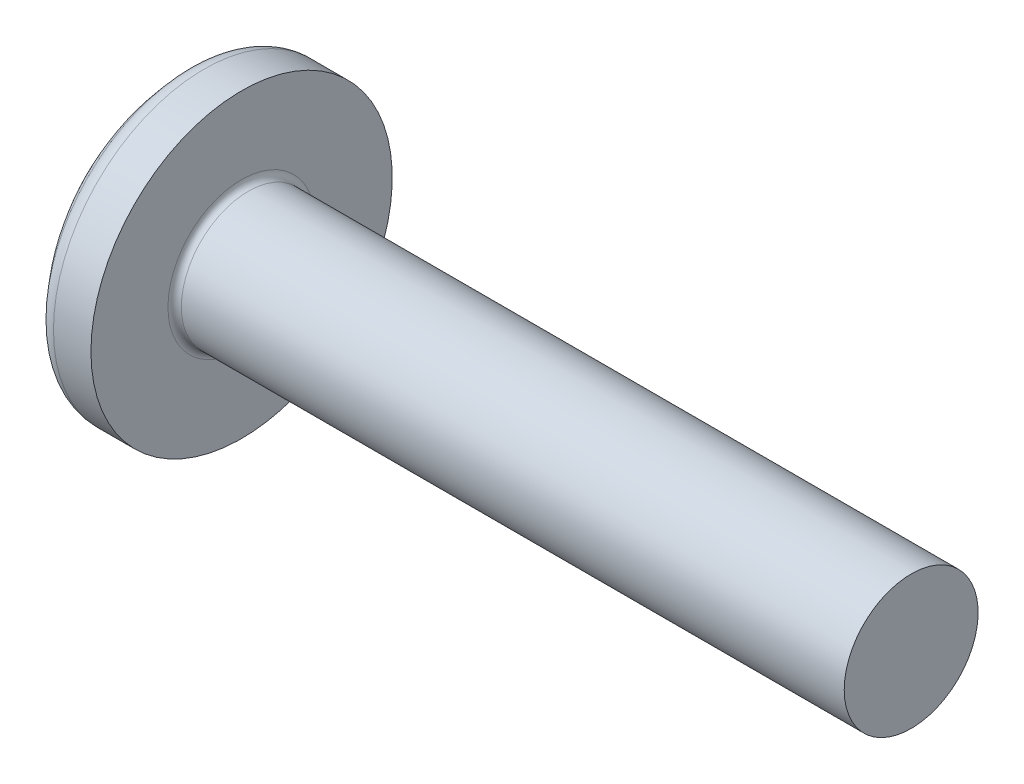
ISO-10303-21;
HEADER;
FILE_DESCRIPTION(('STEP AP214'),'2;1');
FILE_NAME('part.step','',(''),(''),'','','');
FILE_SCHEMA(('AUTOMOTIVE_DESIGN { 1 0 10303 214 1 1 1 1 }'));
ENDSEC;
DATA;
#1=APPLICATION_CONTEXT('core data for automotive mechanical design processes');
#2=APPLICATION_PROTOCOL_DEFINITION('international standard','automotive_design',2000,#1);
#3=PRODUCT_CONTEXT('',#1,'mechanical');
#4=PRODUCT('Part','Part','',(#3));
#5=PRODUCT_RELATED_PRODUCT_CATEGORY('part','',(#4));
#6=PRODUCT_DEFINITION_FORMATION('','',#4);
#7=PRODUCT_DEFINITION_CONTEXT('part definition',#1,'design');
#8=PRODUCT_DEFINITION('design','',#6,#7);
#9=PRODUCT_DEFINITION_SHAPE('','',#8);
#10=(LENGTH_UNIT() NAMED_UNIT(*) SI_UNIT(.MILLI.,.METRE.));
#11=(NAMED_UNIT(*) PLANE_ANGLE_UNIT() SI_UNIT($,.RADIAN.));
#12=(NAMED_UNIT(*) SI_UNIT($,.STERADIAN.) SOLID_ANGLE_UNIT());
#13=UNCERTAINTY_MEASURE_WITH_UNIT(LENGTH_MEASURE(1.E-05),#10,'distance_accuracy_value','');
#14=(GEOMETRIC_REPRESENTATION_CONTEXT(3) GLOBAL_UNCERTAINTY_ASSIGNED_CONTEXT((#13)) GLOBAL_UNIT_ASSIGNED_CONTEXT((#10,
#11,#12)) REPRESENTATION_CONTEXT('',''));
#15=CARTESIAN_POINT('',(0.,0.,0.));
#16=DIRECTION('',(0.,0.,1.));
#17=DIRECTION('',(1.,0.,0.));
#18=AXIS2_PLACEMENT_3D('',#15,#16,#17);
#19=CARTESIAN_POINT('',(3.2,0.,0.));
#20=DIRECTION('',(-1.,0.,0.));
#21=DIRECTION('',(0.,1.,0.));
#22=AXIS2_PLACEMENT_3D('',#19,#20,#21);
#23=SPHERICAL_SURFACE('',#22,3.2);
#24=CARTESIAN_POINT('',(0.841233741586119,0.,0.));
#25=DIRECTION('',(-1.,0.,0.));
#26=DIRECTION('',(0.,0.,1.));
#27=AXIS2_PLACEMENT_3D('',#24,#25,#26);
#28=CIRCLE('',#27,2.16245733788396);
#29=CARTESIAN_POINT('',(0.841233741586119,0.,2.16245733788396));
#30=VERTEX_POINT('',#29);
#31=EDGE_CURVE('E235',#30,#30,#28,.T.);
#32=ORIENTED_EDGE('',*,*,#31,.T.);
#33=EDGE_LOOP('',(#32));
#34=FACE_BOUND('',#33,.T.);
#35=CARTESIAN_POINT('',(0.0716483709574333,0.,0.));
#36=DIRECTION('',(1.,0.,0.));
#37=DIRECTION('',(0.,0.,-1.));
#38=AXIS2_PLACEMENT_3D('',#35,#36,#37);
#39=CIRCLE('',#38,0.673361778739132);
#40=CARTESIAN_POINT('',(0.0716483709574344,-0.369999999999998,-0.562597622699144));
#41=VERTEX_POINT('',#40);
#42=CARTESIAN_POINT('',(0.0716483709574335,-0.56259762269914,-0.37));
#43=VERTEX_POINT('',#42);
#44=EDGE_CURVE('E458',#41,#43,#39,.F.);
#45=ORIENTED_EDGE('',*,*,#44,.F.);
#46=CARTESIAN_POINT('',(3.2,-0.37,0.));
#47=DIRECTION('',(0.,1.,0.));
#48=DIRECTION('',(0.,0.,1.));
#49=AXIS2_PLACEMENT_3D('',#46,#47,#48);
#50=CIRCLE('',#49,3.17853739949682);
#51=CARTESIAN_POINT('',(0.155263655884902,-0.369999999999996,-0.912513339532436));
#52=VERTEX_POINT('',#51);
#53=EDGE_CURVE('E282',#52,#41,#50,.T.);
#54=ORIENTED_EDGE('',*,*,#53,.F.);
#55=CARTESIAN_POINT('',(3.24047110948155,0.,-0.16762475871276));
#56=DIRECTION('',(0.234695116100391,0.,-0.972069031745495));
#57=DIRECTION('',(-0.972069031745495,0.,-0.234695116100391));
#58=AXIS2_PLACEMENT_3D('',#55,#56,#57);
#59=CIRCLE('',#58,3.19535037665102);
#60=CARTESIAN_POINT('',(0.155263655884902,0.370000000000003,-0.912513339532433));
#61=VERTEX_POINT('',#60);
#62=EDGE_CURVE('E254',#52,#61,#59,.T.);
#63=ORIENTED_EDGE('',*,*,#62,.T.);
#64=CARTESIAN_POINT('',(3.2,0.37,0.));
#65=DIRECTION('',(0.,-1.,0.));
#66=DIRECTION('',(0.,0.,-1.));
#67=AXIS2_PLACEMENT_3D('',#64,#65,#66);
#68=CIRCLE('',#67,3.17853739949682);
#69=CARTESIAN_POINT('',(0.0716483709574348,0.370000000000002,-0.562597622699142));
#70=VERTEX_POINT('',#69);
#71=EDGE_CURVE('E290',#70,#61,#68,.T.);
#72=ORIENTED_EDGE('',*,*,#71,.F.);
#73=CARTESIAN_POINT('',(0.0716483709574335,0.562597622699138,-0.37));
#74=VERTEX_POINT('',#73);
#75=EDGE_CURVE('E366',#74,#70,#39,.F.);
#76=ORIENTED_EDGE('',*,*,#75,.F.);
#77=CARTESIAN_POINT('',(3.2,0.,-0.37));
#78=DIRECTION('',(0.,0.,1.));
#79=DIRECTION('',(0.,-1.,0.));
#80=AXIS2_PLACEMENT_3D('',#77,#78,#79);
#81=CIRCLE('',#80,3.17853739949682);
#82=CARTESIAN_POINT('',(0.155263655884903,0.912513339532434,-0.37));
#83=VERTEX_POINT('',#82);
#84=EDGE_CURVE('E248',#83,#74,#81,.T.);
#85=ORIENTED_EDGE('',*,*,#84,.F.);
#86=CARTESIAN_POINT('',(3.24047110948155,0.167624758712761,0.));
#87=DIRECTION('',(0.234695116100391,0.972069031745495,0.));
#88=DIRECTION('',(-0.972069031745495,0.234695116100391,0.));
#89=AXIS2_PLACEMENT_3D('',#86,#87,#88);
#90=CIRCLE('',#89,3.19535037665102);
#91=CARTESIAN_POINT('',(0.155263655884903,0.912513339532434,0.37));
#92=VERTEX_POINT('',#91);
#93=EDGE_CURVE('E251',#83,#92,#90,.T.);
#94=ORIENTED_EDGE('',*,*,#93,.T.);
#95=CARTESIAN_POINT('',(3.2,0.,0.37));
#96=DIRECTION('',(0.,0.,-1.));
#97=DIRECTION('',(0.,1.,0.));
#98=AXIS2_PLACEMENT_3D('',#95,#96,#97);
#99=CIRCLE('',#98,3.17853739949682);
#100=CARTESIAN_POINT('',(0.0716483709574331,0.562597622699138,0.37));
#101=VERTEX_POINT('',#100);
#102=EDGE_CURVE('E244',#101,#92,#99,.T.);
#103=ORIENTED_EDGE('',*,*,#102,.F.);
#104=CARTESIAN_POINT('',(0.0716483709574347,0.369999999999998,0.562597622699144));
#105=VERTEX_POINT('',#104);
#106=EDGE_CURVE('E403',#105,#101,#39,.F.);
#107=ORIENTED_EDGE('',*,*,#106,.F.);
#108=CARTESIAN_POINT('',(0.155263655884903,0.369999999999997,0.912513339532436));
#109=VERTEX_POINT('',#108);
#110=EDGE_CURVE('E264',#109,#105,#68,.T.);
#111=ORIENTED_EDGE('',*,*,#110,.F.);
#112=CARTESIAN_POINT('',(3.24047110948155,0.,0.167624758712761));
#113=DIRECTION('',(0.234695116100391,0.,0.972069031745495));
#114=DIRECTION('',(0.972069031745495,0.,-0.234695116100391));
#115=AXIS2_PLACEMENT_3D('',#112,#113,#114);
#116=CIRCLE('',#115,3.19535037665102);
#117=CARTESIAN_POINT('',(0.155263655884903,-0.370000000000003,0.912513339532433));
#118=VERTEX_POINT('',#117);
#119=EDGE_CURVE('E48',#109,#118,#116,.T.);
#120=ORIENTED_EDGE('',*,*,#119,.T.);
#121=CARTESIAN_POINT('',(0.0716483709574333,-0.370000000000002,0.562597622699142));
#122=VERTEX_POINT('',#121);
#123=EDGE_CURVE('E261',#122,#118,#50,.T.);
#124=ORIENTED_EDGE('',*,*,#123,.F.);
#125=CARTESIAN_POINT('',(0.0716483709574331,-0.562597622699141,0.37));
#126=VERTEX_POINT('',#125);
#127=EDGE_CURVE('E443',#126,#122,#39,.F.);
#128=ORIENTED_EDGE('',*,*,#127,.F.);
#129=CARTESIAN_POINT('',(0.155263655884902,-0.912513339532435,0.37));
#130=VERTEX_POINT('',#129);
#131=EDGE_CURVE('E245',#130,#126,#99,.T.);
#132=ORIENTED_EDGE('',*,*,#131,.F.);
#133=CARTESIAN_POINT('',(3.24047110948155,-0.16762475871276,0.));
#134=DIRECTION('',(0.234695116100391,-0.972069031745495,0.));
#135=DIRECTION('',(0.972069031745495,0.234695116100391,0.));
#136=AXIS2_PLACEMENT_3D('',#133,#134,#135);
#137=CIRCLE('',#136,3.19535037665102);
#138=CARTESIAN_POINT('',(0.155263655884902,-0.912513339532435,-0.37));
#139=VERTEX_POINT('',#138);
#140=EDGE_CURVE('E241',#130,#139,#137,.T.);
#141=ORIENTED_EDGE('',*,*,#140,.T.);
#142=EDGE_CURVE('E63',#43,#139,#81,.T.);
#143=ORIENTED_EDGE('',*,*,#142,.F.);
#144=EDGE_LOOP('',(#45,#54,#63,#72,#76,#85,#94,#103,#107,#111,#120,#124,#128,#132,#141,#143));
#145=FACE_BOUND('',#144,.T.);
#146=ADVANCED_FACE('F34',(#34,#145),#23,.T.);
#147=CARTESIAN_POINT('',(1.75,0.527482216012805,-0.37));
#148=DIRECTION('',(0.,0.,1.));
#149=DIRECTION('',(0.,-1.,0.));
#150=AXIS2_PLACEMENT_3D('',#147,#148,#149);
#151=PLANE('',#150);
#152=ORIENTED_EDGE('',*,*,#84,.T.);
#153=CARTESIAN_POINT('',(-0.971955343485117,0.648166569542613,-0.37));
#154=CARTESIAN_POINT('',(-0.766872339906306,0.631647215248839,-0.37));
#155=CARTESIAN_POINT('',(-0.561800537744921,0.614985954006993,-0.37));
#156=CARTESIAN_POINT('',(-0.151684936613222,0.581268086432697,-0.37));
#157=CARTESIAN_POINT('',(0.0533588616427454,0.564211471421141,-0.37));
#158=CARTESIAN_POINT('',(0.46340379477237,0.529592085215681,-0.37));
#159=CARTESIAN_POINT('',(0.668404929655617,0.512029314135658,-0.37));
#160=CARTESIAN_POINT('',(1.07834476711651,0.476219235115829,-0.37));
#161=CARTESIAN_POINT('',(1.28328347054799,0.457971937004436,-0.37));
#162=CARTESIAN_POINT('',(1.62132593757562,0.427064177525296,-0.37));
#163=CARTESIAN_POINT('',(1.75445532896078,0.414684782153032,-0.37));
#164=CARTESIAN_POINT('',(2.0206619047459,0.38938526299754,-0.37));
#165=CARTESIAN_POINT('',(2.15373908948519,0.376465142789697,-0.37));
#166=CARTESIAN_POINT('',(2.41982964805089,0.349910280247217,-0.37));
#167=CARTESIAN_POINT('',(2.55284301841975,0.336275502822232,-0.37));
#168=CARTESIAN_POINT('',(2.81875830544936,0.307934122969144,-0.37));
#169=CARTESIAN_POINT('',(2.95166021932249,0.293227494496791,-0.37));
#170=CARTESIAN_POINT('',(3.08448262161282,0.277806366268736,-0.37));
#171=B_SPLINE_CURVE_WITH_KNOTS('',3,(#153,#154,#155,#156,#157,#158,#159,#160,#161,#162,#163,
#164,#165,#166,#167,#168,#169,#170),.UNSPECIFIED.,.F.,.F.,(4,2,2,2,2,2,2,2,4),(0.,
0.617242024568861,1.23449761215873,1.85175306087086,2.46899965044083,2.87010992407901,
3.27121754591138,3.67234488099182,4.07348196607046),.UNSPECIFIED.);
#172=CARTESIAN_POINT('',(1.75,0.415013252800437,-0.370000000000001));
#173=VERTEX_POINT('',#172);
#174=EDGE_CURVE('E358',#74,#173,#171,.T.);
#175=ORIENTED_EDGE('',*,*,#174,.T.);
#176=DIRECTION('',(0.,1.,0.));
#177=VECTOR('',#176,1.);
#178=CARTESIAN_POINT('',(1.75,-0.527482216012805,-0.37));
#179=LINE('',#178,#177);
#180=CARTESIAN_POINT('',(1.75,0.527482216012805,-0.37));
#181=VERTEX_POINT('',#180);
#182=EDGE_CURVE('E307',#173,#181,#179,.T.);
#183=ORIENTED_EDGE('',*,*,#182,.T.);
#184=DIRECTION('',(0.972069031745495,-0.234695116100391,0.));
#185=VECTOR('',#184,1.);
#186=CARTESIAN_POINT('',(0.,0.95,-0.37));
#187=LINE('',#186,#185);
#188=EDGE_CURVE('E313',#83,#181,#187,.T.);
#189=ORIENTED_EDGE('',*,*,#188,.F.);
#190=EDGE_LOOP('',(#152,#175,#183,#189));
#191=FACE_BOUND('',#190,.T.);
#192=ADVANCED_FACE('F193',(#191),#151,.T.);
#193=CARTESIAN_POINT('',(1.75,-0.527482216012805,-0.37));
#194=VERTEX_POINT('',#193);
#195=CARTESIAN_POINT('',(1.75,-0.415013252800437,-0.37));
#196=VERTEX_POINT('',#195);
#197=EDGE_CURVE('E304',#194,#196,#179,.T.);
#198=ORIENTED_EDGE('',*,*,#197,.T.);
#199=CARTESIAN_POINT('',(-0.971955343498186,-0.648166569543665,-0.37));
#200=CARTESIAN_POINT('',(-0.766872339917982,-0.631647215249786,-0.37));
#201=CARTESIAN_POINT('',(-0.561800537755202,-0.614985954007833,-0.37));
#202=CARTESIAN_POINT('',(-0.151684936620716,-0.581268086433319,-0.37));
#203=CARTESIAN_POINT('',(0.0533588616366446,-0.564211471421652,-0.37));
#204=CARTESIAN_POINT('',(0.463403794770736,-0.529592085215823,-0.37));
#205=CARTESIAN_POINT('',(0.668404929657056,-0.512029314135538,-0.37));
#206=CARTESIAN_POINT('',(1.0783447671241,-0.476219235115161,-0.37));
#207=CARTESIAN_POINT('',(1.28328347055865,-0.457971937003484,-0.37));
#208=CARTESIAN_POINT('',(1.62132593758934,-0.427064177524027,-0.37));
#209=CARTESIAN_POINT('',(1.75445532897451,-0.414684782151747,-0.37));
#210=CARTESIAN_POINT('',(2.02066190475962,-0.389385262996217,-0.37));
#211=CARTESIAN_POINT('',(2.15373908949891,-0.376465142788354,-0.37));
#212=CARTESIAN_POINT('',(2.4198296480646,-0.349910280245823,-0.37));
#213=CARTESIAN_POINT('',(2.55284301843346,-0.336275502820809,-0.37));
#214=CARTESIAN_POINT('',(2.81875830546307,-0.307934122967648,-0.37));
#215=CARTESIAN_POINT('',(2.95166021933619,-0.293227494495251,-0.37));
#216=CARTESIAN_POINT('',(3.08448262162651,-0.277806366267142,-0.37));
#217=B_SPLINE_CURVE_WITH_KNOTS('',3,(#199,#200,#201,#202,#203,#204,#205,#206,#207,#208,#209,
#210,#211,#212,#213,#214,#215,#216),.UNSPECIFIED.,.F.,.F.,(4,2,2,2,2,2,2,2,4),(0.,
0.617242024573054,1.23449761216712,1.8517530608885,2.46899965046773,2.8701099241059,
3.27121754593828,3.67234488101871,4.07348196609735),.UNSPECIFIED.);
#218=EDGE_CURVE('E350',#196,#43,#217,.F.);
#219=ORIENTED_EDGE('',*,*,#218,.T.);
#220=ORIENTED_EDGE('',*,*,#142,.T.);
#221=DIRECTION('',(0.972069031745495,0.234695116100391,0.));
#222=VECTOR('',#221,1.);
#223=CARTESIAN_POINT('',(0.,-0.95,-0.37));
#224=LINE('',#223,#222);
#225=EDGE_CURVE('E310',#139,#194,#224,.T.);
#226=ORIENTED_EDGE('',*,*,#225,.T.);
#227=EDGE_LOOP('',(#198,#219,#220,#226));
#228=FACE_BOUND('',#227,.T.);
#229=ADVANCED_FACE('F199',(#228),#151,.T.);
#230=CARTESIAN_POINT('',(0.,-0.95,0.37));
#231=DIRECTION('',(0.,0.,-1.));
#232=DIRECTION('',(0.,1.,0.));
#233=AXIS2_PLACEMENT_3D('',#230,#231,#232);
#234=PLANE('',#233);
#235=DIRECTION('',(0.,-1.,0.));
#236=VECTOR('',#235,1.);
#237=CARTESIAN_POINT('',(1.75,0.527482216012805,0.37));
#238=LINE('',#237,#236);
#239=CARTESIAN_POINT('',(1.75,0.527482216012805,0.37));
#240=VERTEX_POINT('',#239);
#241=CARTESIAN_POINT('',(1.75,0.415013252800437,0.37));
#242=VERTEX_POINT('',#241);
#243=EDGE_CURVE('E296',#240,#242,#238,.T.);
#244=ORIENTED_EDGE('',*,*,#243,.T.);
#245=CARTESIAN_POINT('',(-0.971955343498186,0.648166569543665,0.37));
#246=CARTESIAN_POINT('',(-0.766872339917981,0.631647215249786,0.37));
#247=CARTESIAN_POINT('',(-0.561800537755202,0.614985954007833,0.37));
#248=CARTESIAN_POINT('',(-0.151684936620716,0.581268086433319,0.37));
#249=CARTESIAN_POINT('',(0.0533588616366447,0.564211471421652,0.37));
#250=CARTESIAN_POINT('',(0.463403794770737,0.529592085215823,0.37));
#251=CARTESIAN_POINT('',(0.668404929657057,0.512029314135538,0.37));
#252=CARTESIAN_POINT('',(1.0783447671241,0.476219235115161,0.37));
#253=CARTESIAN_POINT('',(1.28328347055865,0.457971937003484,0.37));
#254=CARTESIAN_POINT('',(1.62132593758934,0.427064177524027,0.37));
#255=CARTESIAN_POINT('',(1.75445532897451,0.414684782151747,0.37));
#256=CARTESIAN_POINT('',(2.02066190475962,0.389385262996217,0.37));
#257=CARTESIAN_POINT('',(2.15373908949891,0.376465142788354,0.37));
#258=CARTESIAN_POINT('',(2.4198296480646,0.349910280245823,0.37));
#259=CARTESIAN_POINT('',(2.55284301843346,0.336275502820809,0.37));
#260=CARTESIAN_POINT('',(2.81875830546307,0.307934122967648,0.37));
#261=CARTESIAN_POINT('',(2.95166021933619,0.293227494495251,0.37));
#262=CARTESIAN_POINT('',(3.08448262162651,0.277806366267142,0.37));
#263=B_SPLINE_CURVE_WITH_KNOTS('',3,(#245,#246,#247,#248,#249,#250,#251,#252,#253,#254,#255,
#256,#257,#258,#259,#260,#261,#262),.UNSPECIFIED.,.F.,.F.,(4,2,2,2,2,2,2,2,4),(0.,
0.617242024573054,1.23449761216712,1.8517530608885,2.46899965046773,2.8701099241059,
3.27121754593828,3.67234488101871,4.07348196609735),.UNSPECIFIED.);
#264=EDGE_CURVE('E404',#242,#101,#263,.F.);
#265=ORIENTED_EDGE('',*,*,#264,.T.);
#266=ORIENTED_EDGE('',*,*,#102,.T.);
#267=DIRECTION('',(0.972069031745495,-0.234695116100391,0.));
#268=VECTOR('',#267,1.);
#269=CARTESIAN_POINT('',(0.,0.95,0.37));
#270=LINE('',#269,#268);
#271=EDGE_CURVE('E312',#92,#240,#270,.T.);
#272=ORIENTED_EDGE('',*,*,#271,.T.);
#273=EDGE_LOOP('',(#244,#265,#266,#272));
#274=FACE_BOUND('',#273,.T.);
#275=ADVANCED_FACE('F345',(#274),#234,.T.);
#276=ORIENTED_EDGE('',*,*,#131,.T.);
#277=CARTESIAN_POINT('',(-0.971955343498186,-0.648166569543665,0.37));
#278=CARTESIAN_POINT('',(-0.766872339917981,-0.631647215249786,0.37));
#279=CARTESIAN_POINT('',(-0.561800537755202,-0.614985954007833,0.37));
#280=CARTESIAN_POINT('',(-0.151684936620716,-0.581268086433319,0.37));
#281=CARTESIAN_POINT('',(0.0533588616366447,-0.564211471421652,0.37));
#282=CARTESIAN_POINT('',(0.463403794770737,-0.529592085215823,0.37));
#283=CARTESIAN_POINT('',(0.668404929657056,-0.512029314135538,0.37));
#284=CARTESIAN_POINT('',(1.0783447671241,-0.476219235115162,0.37));
#285=CARTESIAN_POINT('',(1.28328347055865,-0.457971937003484,0.37));
#286=CARTESIAN_POINT('',(1.62132593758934,-0.427064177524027,0.37));
#287=CARTESIAN_POINT('',(1.75445532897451,-0.414684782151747,0.37));
#288=CARTESIAN_POINT('',(2.02066190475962,-0.389385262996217,0.37));
#289=CARTESIAN_POINT('',(2.15373908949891,-0.376465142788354,0.37));
#290=CARTESIAN_POINT('',(2.4198296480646,-0.349910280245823,0.37));
#291=CARTESIAN_POINT('',(2.55284301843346,-0.336275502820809,0.37));
#292=CARTESIAN_POINT('',(2.81875830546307,-0.307934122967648,0.37));
#293=CARTESIAN_POINT('',(2.95166021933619,-0.293227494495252,0.37));
#294=CARTESIAN_POINT('',(3.08448262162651,-0.277806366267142,0.37));
#295=B_SPLINE_CURVE_WITH_KNOTS('',3,(#277,#278,#279,#280,#281,#282,#283,#284,#285,#286,#287,
#288,#289,#290,#291,#292,#293,#294),.UNSPECIFIED.,.F.,.F.,(4,2,2,2,2,2,2,2,4),(0.,
0.617242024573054,1.23449761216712,1.8517530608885,2.46899965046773,2.8701099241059,
3.27121754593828,3.67234488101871,4.07348196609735),.UNSPECIFIED.);
#296=CARTESIAN_POINT('',(1.75,-0.415013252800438,0.37));
#297=VERTEX_POINT('',#296);
#298=EDGE_CURVE('E392',#126,#297,#295,.T.);
#299=ORIENTED_EDGE('',*,*,#298,.T.);
#300=CARTESIAN_POINT('',(1.75,-0.527482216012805,0.37));
#301=VERTEX_POINT('',#300);
#302=EDGE_CURVE('E299',#297,#301,#238,.T.);
#303=ORIENTED_EDGE('',*,*,#302,.T.);
#304=DIRECTION('',(0.972069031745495,0.234695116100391,0.));
#305=VECTOR('',#304,1.);
#306=CARTESIAN_POINT('',(0.,-0.95,0.37));
#307=LINE('',#306,#305);
#308=EDGE_CURVE('E294',#130,#301,#307,.T.);
#309=ORIENTED_EDGE('',*,*,#308,.F.);
#310=EDGE_LOOP('',(#276,#299,#303,#309));
#311=FACE_BOUND('',#310,.T.);
#312=ADVANCED_FACE('F341',(#311),#234,.T.);
#313=CARTESIAN_POINT('',(1.75,0.527482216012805,0.37));
#314=DIRECTION('',(0.234695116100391,0.972069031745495,0.));
#315=DIRECTION('',(-0.972069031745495,0.234695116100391,0.));
#316=AXIS2_PLACEMENT_3D('',#313,#314,#315);
#317=PLANE('',#316);
#318=CARTESIAN_POINT('',(3.40675133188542,0.127478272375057,0.));
#319=DIRECTION('',(0.234695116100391,0.972069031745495,0.));
#320=DIRECTION('',(-0.972069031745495,0.234695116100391,0.));
#321=AXIS2_PLACEMENT_3D('',#318,#319,#320);
#322=ELLIPSE('',#321,1.87540613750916,0.421283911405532);
#323=CARTESIAN_POINT('',(1.75,0.527482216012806,0.175779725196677));
#324=VERTEX_POINT('',#323);
#325=CARTESIAN_POINT('',(1.75,0.527482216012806,-0.175779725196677));
#326=VERTEX_POINT('',#325);
#327=EDGE_CURVE('E435',#324,#326,#322,.F.);
#328=ORIENTED_EDGE('',*,*,#327,.F.);
#329=DIRECTION('',(0.,0.,-1.));
#330=VECTOR('',#329,1.);
#331=CARTESIAN_POINT('',(1.75,0.527482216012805,0.37));
#332=LINE('',#331,#330);
#333=EDGE_CURVE('E300',#240,#324,#332,.T.);
#334=ORIENTED_EDGE('',*,*,#333,.F.);
#335=ORIENTED_EDGE('',*,*,#271,.F.);
#336=ORIENTED_EDGE('',*,*,#93,.F.);
#337=ORIENTED_EDGE('',*,*,#188,.T.);
#338=EDGE_CURVE('E303',#326,#181,#332,.T.);
#339=ORIENTED_EDGE('',*,*,#338,.F.);
#340=EDGE_LOOP('',(#328,#334,#335,#336,#337,#339));
#341=FACE_BOUND('',#340,.T.);
#342=ADVANCED_FACE('F338',(#341),#317,.F.);
#343=CARTESIAN_POINT('',(1.75,-0.527482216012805,-0.37));
#344=DIRECTION('',(0.234695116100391,-0.972069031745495,0.));
#345=DIRECTION('',(0.972069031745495,0.234695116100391,0.));
#346=AXIS2_PLACEMENT_3D('',#343,#344,#345);
#347=PLANE('',#346);
#348=CARTESIAN_POINT('',(3.40675133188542,-0.127478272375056,0.));
#349=DIRECTION('',(0.234695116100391,-0.972069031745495,0.));
#350=DIRECTION('',(-0.972069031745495,-0.234695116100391,0.));
#351=AXIS2_PLACEMENT_3D('',#348,#349,#350);
#352=ELLIPSE('',#351,1.87540613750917,0.421283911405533);
#353=CARTESIAN_POINT('',(1.75,-0.527482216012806,-0.175779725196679));
#354=VERTEX_POINT('',#353);
#355=CARTESIAN_POINT('',(1.75,-0.527482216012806,0.175779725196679));
#356=VERTEX_POINT('',#355);
#357=EDGE_CURVE('E431',#354,#356,#352,.F.);
#358=ORIENTED_EDGE('',*,*,#357,.F.);
#359=DIRECTION('',(0.,0.,1.));
#360=VECTOR('',#359,1.);
#361=CARTESIAN_POINT('',(1.75,-0.527482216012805,-0.37));
#362=LINE('',#361,#360);
#363=EDGE_CURVE('E291',#194,#354,#362,.T.);
#364=ORIENTED_EDGE('',*,*,#363,.F.);
#365=ORIENTED_EDGE('',*,*,#225,.F.);
#366=ORIENTED_EDGE('',*,*,#140,.F.);
#367=ORIENTED_EDGE('',*,*,#308,.T.);
#368=EDGE_CURVE('E295',#356,#301,#362,.T.);
#369=ORIENTED_EDGE('',*,*,#368,.F.);
#370=EDGE_LOOP('',(#358,#364,#365,#366,#367,#369));
#371=FACE_BOUND('',#370,.T.);
#372=ADVANCED_FACE('F340',(#371),#347,.F.);
#373=CARTESIAN_POINT('',(1.75,0.527482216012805,-0.37));
#374=DIRECTION('',(-1.,0.,0.));
#375=DIRECTION('',(0.,0.,1.));
#376=AXIS2_PLACEMENT_3D('',#373,#374,#375);
#377=PLANE('',#376);
#378=DIRECTION('',(0.,1.,0.));
#379=VECTOR('',#378,1.);
#380=CARTESIAN_POINT('',(1.75,-0.370000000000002,0.527482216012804));
#381=LINE('',#380,#379);
#382=CARTESIAN_POINT('',(1.75,-0.370000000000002,0.527482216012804));
#383=VERTEX_POINT('',#382);
#384=CARTESIAN_POINT('',(1.75,-0.175779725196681,0.527482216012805));
#385=VERTEX_POINT('',#384);
#386=EDGE_CURVE('E499',#383,#385,#381,.T.);
#387=ORIENTED_EDGE('',*,*,#386,.T.);
#388=CARTESIAN_POINT('',(1.75,0.,0.));
#389=DIRECTION('',(-1.,0.,0.));
#390=DIRECTION('',(0.,0.,1.));
#391=AXIS2_PLACEMENT_3D('',#388,#389,#390);
#392=CIRCLE('',#391,0.556);
#393=CARTESIAN_POINT('',(1.75,-0.370000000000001,0.415013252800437));
#394=VERTEX_POINT('',#393);
#395=EDGE_CURVE('E456',#394,#385,#392,.T.);
#396=ORIENTED_EDGE('',*,*,#395,.F.);
#397=DIRECTION('',(0.,0.,-1.));
#398=VECTOR('',#397,1.);
#399=CARTESIAN_POINT('',(1.75,-0.370000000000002,0.527482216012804));
#400=LINE('',#399,#398);
#401=EDGE_CURVE('E494',#383,#394,#400,.T.);
#402=ORIENTED_EDGE('',*,*,#401,.F.);
#403=EDGE_LOOP('',(#387,#396,#402));
#404=FACE_BOUND('',#403,.T.);
#405=ADVANCED_FACE('F420',(#404),#377,.T.);
#406=ORIENTED_EDGE('',*,*,#302,.F.);
#407=EDGE_CURVE('E451',#356,#297,#392,.T.);
#408=ORIENTED_EDGE('',*,*,#407,.F.);
#409=ORIENTED_EDGE('',*,*,#368,.T.);
#410=EDGE_LOOP('',(#406,#408,#409));
#411=FACE_BOUND('',#410,.T.);
#412=ADVANCED_FACE('F422',(#411),#377,.T.);
#413=ORIENTED_EDGE('',*,*,#363,.T.);
#414=EDGE_CURVE('E440',#196,#354,#392,.T.);
#415=ORIENTED_EDGE('',*,*,#414,.F.);
#416=ORIENTED_EDGE('',*,*,#197,.F.);
#417=EDGE_LOOP('',(#413,#415,#416));
#418=FACE_BOUND('',#417,.T.);
#419=ADVANCED_FACE('F438',(#418),#377,.T.);
#420=CARTESIAN_POINT('',(1.75,-0.369999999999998,-0.415013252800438));
#421=VERTEX_POINT('',#420);
#422=CARTESIAN_POINT('',(1.75,-0.369999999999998,-0.527482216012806));
#423=VERTEX_POINT('',#422);
#424=EDGE_CURVE('E488',#421,#423,#400,.T.);
#425=ORIENTED_EDGE('',*,*,#424,.F.);
#426=CARTESIAN_POINT('',(1.75,-0.175779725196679,-0.527482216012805));
#427=VERTEX_POINT('',#426);
#428=EDGE_CURVE('E55',#427,#421,#392,.T.);
#429=ORIENTED_EDGE('',*,*,#428,.F.);
#430=DIRECTION('',(0.,-1.,0.));
#431=VECTOR('',#430,1.);
#432=CARTESIAN_POINT('',(1.75,0.370000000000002,-0.527482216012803));
#433=LINE('',#432,#431);
#434=EDGE_CURVE('E486',#427,#423,#433,.T.);
#435=ORIENTED_EDGE('',*,*,#434,.T.);
#436=EDGE_LOOP('',(#425,#429,#435));
#437=FACE_BOUND('',#436,.T.);
#438=ADVANCED_FACE('F485',(#437),#377,.T.);
#439=CARTESIAN_POINT('',(1.75,0.370000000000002,-0.527482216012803));
#440=VERTEX_POINT('',#439);
#441=CARTESIAN_POINT('',(1.75,0.175779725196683,-0.527482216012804));
#442=VERTEX_POINT('',#441);
#443=EDGE_CURVE('E493',#440,#442,#433,.T.);
#444=ORIENTED_EDGE('',*,*,#443,.T.);
#445=CARTESIAN_POINT('',(1.75,0.370000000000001,-0.415013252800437));
#446=VERTEX_POINT('',#445);
#447=EDGE_CURVE('E482',#446,#442,#392,.T.);
#448=ORIENTED_EDGE('',*,*,#447,.F.);
#449=DIRECTION('',(0.,0.,1.));
#450=VECTOR('',#449,1.);
#451=CARTESIAN_POINT('',(1.75,0.370000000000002,-0.527482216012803));
#452=LINE('',#451,#450);
#453=EDGE_CURVE('E503',#440,#446,#452,.T.);
#454=ORIENTED_EDGE('',*,*,#453,.F.);
#455=EDGE_LOOP('',(#444,#448,#454));
#456=FACE_BOUND('',#455,.T.);
#457=ADVANCED_FACE('F510',(#456),#377,.T.);
#458=ORIENTED_EDGE('',*,*,#182,.F.);
#459=EDGE_CURVE('E512',#326,#173,#392,.T.);
#460=ORIENTED_EDGE('',*,*,#459,.F.);
#461=ORIENTED_EDGE('',*,*,#338,.T.);
#462=EDGE_LOOP('',(#458,#460,#461));
#463=FACE_BOUND('',#462,.T.);
#464=ADVANCED_FACE('F538',(#463),#377,.T.);
#465=ORIENTED_EDGE('',*,*,#333,.T.);
#466=EDGE_CURVE('E517',#242,#324,#392,.T.);
#467=ORIENTED_EDGE('',*,*,#466,.F.);
#468=ORIENTED_EDGE('',*,*,#243,.F.);
#469=EDGE_LOOP('',(#465,#467,#468));
#470=FACE_BOUND('',#469,.T.);
#471=ADVANCED_FACE('F526',(#470),#377,.T.);
#472=CARTESIAN_POINT('',(1.75,0.369999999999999,0.415013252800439));
#473=VERTEX_POINT('',#472);
#474=CARTESIAN_POINT('',(1.75,0.369999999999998,0.527482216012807));
#475=VERTEX_POINT('',#474);
#476=EDGE_CURVE('E279',#473,#475,#452,.T.);
#477=ORIENTED_EDGE('',*,*,#476,.F.);
#478=CARTESIAN_POINT('',(1.75,0.175779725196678,0.527482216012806));
#479=VERTEX_POINT('',#478);
#480=EDGE_CURVE('E457',#479,#473,#392,.T.);
#481=ORIENTED_EDGE('',*,*,#480,.F.);
#482=EDGE_CURVE('E502',#479,#475,#381,.T.);
#483=ORIENTED_EDGE('',*,*,#482,.T.);
#484=EDGE_LOOP('',(#477,#481,#483));
#485=FACE_BOUND('',#484,.T.);
#486=ADVANCED_FACE('F414',(#485),#377,.T.);
#487=CARTESIAN_POINT('',(1.75,0.369999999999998,0.527482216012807));
#488=DIRECTION('',(0.,-1.,0.));
#489=DIRECTION('',(0.,0.,-1.));
#490=AXIS2_PLACEMENT_3D('',#487,#488,#489);
#491=PLANE('',#490);
#492=ORIENTED_EDGE('',*,*,#110,.T.);
#493=CARTESIAN_POINT('',(-0.971955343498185,0.369999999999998,0.648166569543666));
#494=CARTESIAN_POINT('',(-0.766872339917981,0.369999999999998,0.631647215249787));
#495=CARTESIAN_POINT('',(-0.561800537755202,0.369999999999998,0.614985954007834));
#496=CARTESIAN_POINT('',(-0.151684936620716,0.369999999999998,0.58126808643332));
#497=CARTESIAN_POINT('',(0.0533588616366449,0.369999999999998,0.564211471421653));
#498=CARTESIAN_POINT('',(0.463403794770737,0.369999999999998,0.529592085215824));
#499=CARTESIAN_POINT('',(0.668404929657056,0.369999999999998,0.512029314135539));
#500=CARTESIAN_POINT('',(1.0783447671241,0.369999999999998,0.476219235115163));
#501=CARTESIAN_POINT('',(1.28328347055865,0.369999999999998,0.457971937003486));
#502=CARTESIAN_POINT('',(1.62132593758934,0.369999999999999,0.427064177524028));
#503=CARTESIAN_POINT('',(1.75445532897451,0.369999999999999,0.414684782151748));
#504=CARTESIAN_POINT('',(2.02066190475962,0.369999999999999,0.389385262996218));
#505=CARTESIAN_POINT('',(2.15373908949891,0.369999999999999,0.376465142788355));
#506=CARTESIAN_POINT('',(2.4198296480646,0.369999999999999,0.349910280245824));
#507=CARTESIAN_POINT('',(2.55284301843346,0.369999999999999,0.33627550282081));
#508=CARTESIAN_POINT('',(2.81875830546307,0.369999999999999,0.307934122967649));
#509=CARTESIAN_POINT('',(2.95166021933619,0.369999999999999,0.293227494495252));
#510=CARTESIAN_POINT('',(3.08448262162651,0.369999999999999,0.277806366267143));
#511=B_SPLINE_CURVE_WITH_KNOTS('',3,(#493,#494,#495,#496,#497,#498,#499,#500,#501,#502,#503,
#504,#505,#506,#507,#508,#509,#510),.UNSPECIFIED.,.F.,.F.,(4,2,2,2,2,2,2,2,4),(0.,
0.617242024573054,1.23449761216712,1.8517530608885,2.46899965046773,2.8701099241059,
3.27121754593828,3.67234488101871,4.07348196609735),.UNSPECIFIED.);
#512=EDGE_CURVE('E398',#105,#473,#511,.T.);
#513=ORIENTED_EDGE('',*,*,#512,.T.);
#514=ORIENTED_EDGE('',*,*,#476,.T.);
#515=DIRECTION('',(0.972069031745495,0.,-0.234695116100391));
#516=VECTOR('',#515,1.);
#517=CARTESIAN_POINT('',(0.,0.369999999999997,0.950000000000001));
#518=LINE('',#517,#516);
#519=EDGE_CURVE('E272',#109,#475,#518,.T.);
#520=ORIENTED_EDGE('',*,*,#519,.F.);
#521=EDGE_LOOP('',(#492,#513,#514,#520));
#522=FACE_BOUND('',#521,.T.);
#523=ADVANCED_FACE('F276',(#522),#491,.T.);
#524=CARTESIAN_POINT('',(0.,-0.369999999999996,-0.950000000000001));
#525=DIRECTION('',(0.,1.,0.));
#526=DIRECTION('',(0.,0.,1.));
#527=AXIS2_PLACEMENT_3D('',#524,#525,#526);
#528=PLANE('',#527);
#529=ORIENTED_EDGE('',*,*,#401,.T.);
#530=CARTESIAN_POINT('',(-0.971955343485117,-0.370000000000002,0.648166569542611));
#531=CARTESIAN_POINT('',(-0.766872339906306,-0.370000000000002,0.631647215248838));
#532=CARTESIAN_POINT('',(-0.561800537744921,-0.370000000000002,0.614985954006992));
#533=CARTESIAN_POINT('',(-0.151684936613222,-0.370000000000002,0.581268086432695));
#534=CARTESIAN_POINT('',(0.0533588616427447,-0.370000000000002,0.56421147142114));
#535=CARTESIAN_POINT('',(0.46340379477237,-0.370000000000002,0.529592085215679));
#536=CARTESIAN_POINT('',(0.668404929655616,-0.370000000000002,0.512029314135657));
#537=CARTESIAN_POINT('',(1.07834476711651,-0.370000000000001,0.476219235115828));
#538=CARTESIAN_POINT('',(1.28328347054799,-0.370000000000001,0.457971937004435));
#539=CARTESIAN_POINT('',(1.62132593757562,-0.370000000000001,0.427064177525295));
#540=CARTESIAN_POINT('',(1.75445532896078,-0.370000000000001,0.414684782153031));
#541=CARTESIAN_POINT('',(2.0206619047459,-0.370000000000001,0.389385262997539));
#542=CARTESIAN_POINT('',(2.15373908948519,-0.370000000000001,0.376465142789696));
#543=CARTESIAN_POINT('',(2.41982964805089,-0.370000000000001,0.349910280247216));
#544=CARTESIAN_POINT('',(2.55284301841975,-0.370000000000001,0.336275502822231));
#545=CARTESIAN_POINT('',(2.81875830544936,-0.370000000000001,0.307934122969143));
#546=CARTESIAN_POINT('',(2.95166021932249,-0.370000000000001,0.29322749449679));
#547=CARTESIAN_POINT('',(3.08448262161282,-0.370000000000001,0.277806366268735));
#548=B_SPLINE_CURVE_WITH_KNOTS('',3,(#530,#531,#532,#533,#534,#535,#536,#537,#538,#539,#540,
#541,#542,#543,#544,#545,#546,#547),.UNSPECIFIED.,.F.,.F.,(4,2,2,2,2,2,2,2,4),(0.,
0.617242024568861,1.23449761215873,1.85175306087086,2.46899965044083,2.87010992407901,
3.27121754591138,3.67234488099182,4.07348196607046),.UNSPECIFIED.);
#549=EDGE_CURVE('E386',#394,#122,#548,.F.);
#550=ORIENTED_EDGE('',*,*,#549,.T.);
#551=ORIENTED_EDGE('',*,*,#123,.T.);
#552=DIRECTION('',(0.972069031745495,0.,-0.234695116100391));
#553=VECTOR('',#552,1.);
#554=CARTESIAN_POINT('',(0.,-0.370000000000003,0.949999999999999));
#555=LINE('',#554,#553);
#556=EDGE_CURVE('E274',#118,#383,#555,.T.);
#557=ORIENTED_EDGE('',*,*,#556,.T.);
#558=EDGE_LOOP('',(#529,#550,#551,#557));
#559=FACE_BOUND('',#558,.T.);
#560=ADVANCED_FACE('F413',(#559),#528,.T.);
#561=CARTESIAN_POINT('',(1.75,-0.370000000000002,0.527482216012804));
#562=DIRECTION('',(0.234695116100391,0.,0.972069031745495));
#563=DIRECTION('',(-0.972069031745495,0.,0.234695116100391));
#564=AXIS2_PLACEMENT_3D('',#561,#562,#563);
#565=PLANE('',#564);
#566=CARTESIAN_POINT('',(3.40675133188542,0.,0.127478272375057));
#567=DIRECTION('',(0.234695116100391,0.,0.972069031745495));
#568=DIRECTION('',(-0.972069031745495,0.,0.234695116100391));
#569=AXIS2_PLACEMENT_3D('',#566,#567,#568);
#570=ELLIPSE('',#569,1.87540613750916,0.421283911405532);
#571=EDGE_CURVE('E466',#385,#479,#570,.F.);
#572=ORIENTED_EDGE('',*,*,#571,.F.);
#573=ORIENTED_EDGE('',*,*,#386,.F.);
#574=ORIENTED_EDGE('',*,*,#556,.F.);
#575=ORIENTED_EDGE('',*,*,#119,.F.);
#576=ORIENTED_EDGE('',*,*,#519,.T.);
#577=ORIENTED_EDGE('',*,*,#482,.F.);
#578=EDGE_LOOP('',(#572,#573,#574,#575,#576,#577));
#579=FACE_BOUND('',#578,.T.);
#580=ADVANCED_FACE('F270',(#579),#565,.F.);
#581=CARTESIAN_POINT('',(1.75,0.370000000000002,-0.527482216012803));
#582=DIRECTION('',(0.234695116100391,0.,-0.972069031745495));
#583=DIRECTION('',(0.972069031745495,0.,0.234695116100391));
#584=AXIS2_PLACEMENT_3D('',#581,#582,#583);
#585=PLANE('',#584);
#586=CARTESIAN_POINT('',(3.40675133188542,0.,-0.127478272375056));
#587=DIRECTION('',(0.234695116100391,0.,-0.972069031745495));
#588=DIRECTION('',(-0.972069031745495,0.,-0.234695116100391));
#589=AXIS2_PLACEMENT_3D('',#586,#587,#588);
#590=ELLIPSE('',#589,1.87540613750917,0.421283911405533);
#591=EDGE_CURVE('E365',#442,#427,#590,.F.);
#592=ORIENTED_EDGE('',*,*,#591,.F.);
#593=ORIENTED_EDGE('',*,*,#443,.F.);
#594=DIRECTION('',(0.972069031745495,0.,0.234695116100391));
#595=VECTOR('',#594,1.);
#596=CARTESIAN_POINT('',(0.,0.370000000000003,-0.949999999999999));
#597=LINE('',#596,#595);
#598=EDGE_CURVE('E284',#61,#440,#597,.T.);
#599=ORIENTED_EDGE('',*,*,#598,.F.);
#600=ORIENTED_EDGE('',*,*,#62,.F.);
#601=DIRECTION('',(0.972069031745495,0.,0.234695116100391));
#602=VECTOR('',#601,1.);
#603=CARTESIAN_POINT('',(0.,-0.369999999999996,-0.950000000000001));
#604=LINE('',#603,#602);
#605=EDGE_CURVE('E492',#52,#423,#604,.T.);
#606=ORIENTED_EDGE('',*,*,#605,.T.);
#607=ORIENTED_EDGE('',*,*,#434,.F.);
#608=EDGE_LOOP('',(#592,#593,#599,#600,#606,#607));
#609=FACE_BOUND('',#608,.T.);
#610=ADVANCED_FACE('F376',(#609),#585,.F.);
#611=ORIENTED_EDGE('',*,*,#453,.T.);
#612=CARTESIAN_POINT('',(-0.971955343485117,0.370000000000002,-0.648166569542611));
#613=CARTESIAN_POINT('',(-0.766872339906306,0.370000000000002,-0.631647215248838));
#614=CARTESIAN_POINT('',(-0.561800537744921,0.370000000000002,-0.614985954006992));
#615=CARTESIAN_POINT('',(-0.151684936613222,0.370000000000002,-0.581268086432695));
#616=CARTESIAN_POINT('',(0.0533588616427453,0.370000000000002,-0.56421147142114));
#617=CARTESIAN_POINT('',(0.46340379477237,0.370000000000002,-0.529592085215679));
#618=CARTESIAN_POINT('',(0.668404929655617,0.370000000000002,-0.512029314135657));
#619=CARTESIAN_POINT('',(1.07834476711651,0.370000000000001,-0.476219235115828));
#620=CARTESIAN_POINT('',(1.28328347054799,0.370000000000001,-0.457971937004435));
#621=CARTESIAN_POINT('',(1.62132593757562,0.370000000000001,-0.427064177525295));
#622=CARTESIAN_POINT('',(1.75445532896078,0.370000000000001,-0.414684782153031));
#623=CARTESIAN_POINT('',(2.0206619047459,0.370000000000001,-0.389385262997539));
#624=CARTESIAN_POINT('',(2.15373908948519,0.370000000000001,-0.376465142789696));
#625=CARTESIAN_POINT('',(2.41982964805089,0.370000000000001,-0.349910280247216));
#626=CARTESIAN_POINT('',(2.55284301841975,0.370000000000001,-0.336275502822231));
#627=CARTESIAN_POINT('',(2.81875830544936,0.370000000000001,-0.307934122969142));
#628=CARTESIAN_POINT('',(2.95166021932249,0.370000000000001,-0.29322749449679));
#629=CARTESIAN_POINT('',(3.08448262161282,0.370000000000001,-0.277806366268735));
#630=B_SPLINE_CURVE_WITH_KNOTS('',3,(#612,#613,#614,#615,#616,#617,#618,#619,#620,#621,#622,
#623,#624,#625,#626,#627,#628,#629),.UNSPECIFIED.,.F.,.F.,(4,2,2,2,2,2,2,2,4),(0.,
0.617242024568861,1.23449761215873,1.85175306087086,2.46899965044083,2.87010992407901,
3.27121754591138,3.67234488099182,4.07348196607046),.UNSPECIFIED.);
#631=EDGE_CURVE('E367',#446,#70,#630,.F.);
#632=ORIENTED_EDGE('',*,*,#631,.T.);
#633=ORIENTED_EDGE('',*,*,#71,.T.);
#634=ORIENTED_EDGE('',*,*,#598,.T.);
#635=EDGE_LOOP('',(#611,#632,#633,#634));
#636=FACE_BOUND('',#635,.T.);
#637=ADVANCED_FACE('F415',(#636),#491,.T.);
#638=ORIENTED_EDGE('',*,*,#53,.T.);
#639=CARTESIAN_POINT('',(-0.971955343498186,-0.369999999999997,-0.648166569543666));
#640=CARTESIAN_POINT('',(-0.766872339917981,-0.369999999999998,-0.631647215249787));
#641=CARTESIAN_POINT('',(-0.561800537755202,-0.369999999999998,-0.614985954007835));
#642=CARTESIAN_POINT('',(-0.151684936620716,-0.369999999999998,-0.58126808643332));
#643=CARTESIAN_POINT('',(0.0533588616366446,-0.369999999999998,-0.564211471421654));
#644=CARTESIAN_POINT('',(0.463403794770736,-0.369999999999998,-0.529592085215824));
#645=CARTESIAN_POINT('',(0.668404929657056,-0.369999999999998,-0.512029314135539));
#646=CARTESIAN_POINT('',(1.0783447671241,-0.369999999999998,-0.476219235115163));
#647=CARTESIAN_POINT('',(1.28328347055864,-0.369999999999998,-0.457971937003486));
#648=CARTESIAN_POINT('',(1.62132593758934,-0.369999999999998,-0.427064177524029));
#649=CARTESIAN_POINT('',(1.75445532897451,-0.369999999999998,-0.414684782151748));
#650=CARTESIAN_POINT('',(2.02066190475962,-0.369999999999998,-0.389385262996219));
#651=CARTESIAN_POINT('',(2.15373908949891,-0.369999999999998,-0.376465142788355));
#652=CARTESIAN_POINT('',(2.4198296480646,-0.369999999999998,-0.349910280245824));
#653=CARTESIAN_POINT('',(2.55284301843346,-0.369999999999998,-0.33627550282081));
#654=CARTESIAN_POINT('',(2.81875830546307,-0.369999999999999,-0.307934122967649));
#655=CARTESIAN_POINT('',(2.95166021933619,-0.369999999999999,-0.293227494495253));
#656=CARTESIAN_POINT('',(3.08448262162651,-0.369999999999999,-0.277806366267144));
#657=B_SPLINE_CURVE_WITH_KNOTS('',3,(#639,#640,#641,#642,#643,#644,#645,#646,#647,#648,#649,
#650,#651,#652,#653,#654,#655,#656),.UNSPECIFIED.,.F.,.F.,(4,2,2,2,2,2,2,2,4),(0.,
0.617242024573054,1.23449761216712,1.8517530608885,2.46899965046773,2.8701099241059,
3.27121754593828,3.67234488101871,4.07348196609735),.UNSPECIFIED.);
#658=EDGE_CURVE('E11',#41,#421,#657,.T.);
#659=ORIENTED_EDGE('',*,*,#658,.T.);
#660=ORIENTED_EDGE('',*,*,#424,.T.);
#661=ORIENTED_EDGE('',*,*,#605,.F.);
#662=EDGE_LOOP('',(#638,#659,#660,#661));
#663=FACE_BOUND('',#662,.T.);
#664=ADVANCED_FACE('F221',(#663),#528,.T.);
#665=CARTESIAN_POINT('',(-25.4,0.,0.));
#666=DIRECTION('',(-1.,0.,0.));
#667=DIRECTION('',(0.,0.,1.));
#668=AXIS2_PLACEMENT_3D('',#665,#666,#667);
#669=CYLINDRICAL_SURFACE('',#668,1.);
#670=CARTESIAN_POINT('',(1.7,0.,0.));
#671=DIRECTION('',(-1.,0.,0.));
#672=DIRECTION('',(0.,0.,1.));
#673=AXIS2_PLACEMENT_3D('',#670,#671,#672);
#674=CIRCLE('',#673,1.);
#675=CARTESIAN_POINT('',(1.7,0.,1.));
#676=VERTEX_POINT('',#675);
#677=EDGE_CURVE('E232',#676,#676,#674,.F.);
#678=ORIENTED_EDGE('',*,*,#677,.T.);
#679=EDGE_LOOP('',(#678));
#680=FACE_BOUND('',#679,.T.);
#681=CARTESIAN_POINT('',(11.6,0.,0.));
#682=DIRECTION('',(-1.,0.,0.));
#683=DIRECTION('',(0.,0.,1.));
#684=AXIS2_PLACEMENT_3D('',#681,#682,#683);
#685=CIRCLE('',#684,1.);
#686=CARTESIAN_POINT('',(11.6,0.,1.));
#687=VERTEX_POINT('',#686);
#688=EDGE_CURVE('E316',#687,#687,#685,.T.);
#689=ORIENTED_EDGE('',*,*,#688,.T.);
#690=EDGE_LOOP('',(#689));
#691=FACE_BOUND('',#690,.T.);
#692=ADVANCED_FACE('F36',(#680,#691),#669,.T.);
#693=CARTESIAN_POINT('',(1.6,1.,0.));
#694=DIRECTION('',(-1.,0.,0.));
#695=DIRECTION('',(0.,0.,1.));
#696=AXIS2_PLACEMENT_3D('',#693,#694,#695);
#697=PLANE('',#696);
#698=CARTESIAN_POINT('',(1.6,0.,0.));
#699=DIRECTION('',(-1.,0.,0.));
#700=DIRECTION('',(0.,0.,1.));
#701=AXIS2_PLACEMENT_3D('',#698,#699,#700);
#702=CIRCLE('',#701,1.1);
#703=CARTESIAN_POINT('',(1.6,0.,1.1));
#704=VERTEX_POINT('',#703);
#705=EDGE_CURVE('E226',#704,#704,#702,.T.);
#706=ORIENTED_EDGE('',*,*,#705,.T.);
#707=EDGE_LOOP('',(#706));
#708=FACE_BOUND('',#707,.T.);
#709=CARTESIAN_POINT('',(1.6,0.,0.));
#710=DIRECTION('',(-1.,0.,0.));
#711=DIRECTION('',(0.,0.,1.));
#712=AXIS2_PLACEMENT_3D('',#709,#710,#711);
#713=CIRCLE('',#712,2.25);
#714=CARTESIAN_POINT('',(1.6,0.,2.25));
#715=VERTEX_POINT('',#714);
#716=EDGE_CURVE('E229',#715,#715,#713,.T.);
#717=ORIENTED_EDGE('',*,*,#716,.F.);
#718=EDGE_LOOP('',(#717));
#719=FACE_BOUND('',#718,.T.);
#720=ADVANCED_FACE('F214',(#708,#719),#697,.F.);
#721=CARTESIAN_POINT('',(-25.4,0.,0.));
#722=DIRECTION('',(-1.,0.,0.));
#723=DIRECTION('',(0.,0.,1.));
#724=AXIS2_PLACEMENT_3D('',#721,#722,#723);
#725=CYLINDRICAL_SURFACE('',#724,2.25);
#726=ORIENTED_EDGE('',*,*,#716,.T.);
#727=EDGE_LOOP('',(#726));
#728=FACE_BOUND('',#727,.T.);
#729=CARTESIAN_POINT('',(1.04025464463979,0.,0.));
#730=DIRECTION('',(-1.,0.,0.));
#731=DIRECTION('',(0.,0.,1.));
#732=AXIS2_PLACEMENT_3D('',#729,#730,#731);
#733=CIRCLE('',#732,2.25);
#734=CARTESIAN_POINT('',(1.04025464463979,0.,2.25));
#735=VERTEX_POINT('',#734);
#736=EDGE_CURVE('E230',#735,#735,#733,.T.);
#737=ORIENTED_EDGE('',*,*,#736,.F.);
#738=EDGE_LOOP('',(#737));
#739=FACE_BOUND('',#738,.T.);
#740=ADVANCED_FACE('F211',(#728,#739),#725,.T.);
#741=CARTESIAN_POINT('',(1.04025464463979,0.,0.));
#742=DIRECTION('',(-1.,0.,0.));
#743=DIRECTION('',(0.,0.,1.));
#744=AXIS2_PLACEMENT_3D('',#741,#742,#743);
#745=TOROIDAL_SURFACE('',#744,1.98,0.27);
#746=ORIENTED_EDGE('',*,*,#736,.T.);
#747=EDGE_LOOP('',(#746));
#748=FACE_BOUND('',#747,.T.);
#749=ORIENTED_EDGE('',*,*,#31,.F.);
#750=EDGE_LOOP('',(#749));
#751=FACE_BOUND('',#750,.T.);
#752=ADVANCED_FACE('F208',(#748,#751),#745,.T.);
#753=CARTESIAN_POINT('',(11.6,1.,0.));
#754=DIRECTION('',(1.,0.,0.));
#755=DIRECTION('',(0.,0.,-1.));
#756=AXIS2_PLACEMENT_3D('',#753,#754,#755);
#757=PLANE('',#756);
#758=ORIENTED_EDGE('',*,*,#688,.F.);
#759=EDGE_LOOP('',(#758));
#760=FACE_BOUND('',#759,.T.);
#761=ADVANCED_FACE('F206',(#760),#757,.T.);
#762=CARTESIAN_POINT('',(1.7,0.,0.));
#763=DIRECTION('',(-1.,0.,0.));
#764=DIRECTION('',(0.,0.,1.));
#765=AXIS2_PLACEMENT_3D('',#762,#763,#764);
#766=TOROIDAL_SURFACE('',#765,1.1,0.1);
#767=ORIENTED_EDGE('',*,*,#677,.F.);
#768=EDGE_LOOP('',(#767));
#769=FACE_BOUND('',#768,.T.);
#770=ORIENTED_EDGE('',*,*,#705,.F.);
#771=EDGE_LOOP('',(#770));
#772=FACE_BOUND('',#771,.T.);
#773=ADVANCED_FACE('F325',(#769,#772),#766,.F.);
#774=CARTESIAN_POINT('',(1.75,0.,0.));
#775=DIRECTION('',(-1.,0.,0.));
#776=DIRECTION('',(0.,0.,1.));
#777=AXIS2_PLACEMENT_3D('',#774,#775,#776);
#778=CONICAL_SURFACE('',#777,0.556,0.069813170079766);
#779=ORIENTED_EDGE('',*,*,#327,.T.);
#780=EDGE_CURVE('E514',#324,#326,#392,.T.);
#781=ORIENTED_EDGE('',*,*,#780,.F.);
#782=EDGE_LOOP('',(#779,#781));
#783=FACE_BOUND('',#782,.T.);
#784=ADVANCED_FACE('F190',(#783),#778,.F.);
#785=ORIENTED_EDGE('',*,*,#357,.T.);
#786=EDGE_CURVE('E453',#354,#356,#392,.T.);
#787=ORIENTED_EDGE('',*,*,#786,.F.);
#788=EDGE_LOOP('',(#785,#787));
#789=FACE_BOUND('',#788,.T.);
#790=ADVANCED_FACE('F333',(#789),#778,.F.);
#791=EDGE_CURVE('E459',#473,#242,#392,.T.);
#792=ORIENTED_EDGE('',*,*,#791,.F.);
#793=ORIENTED_EDGE('',*,*,#512,.F.);
#794=ORIENTED_EDGE('',*,*,#106,.T.);
#795=ORIENTED_EDGE('',*,*,#264,.F.);
#796=EDGE_LOOP('',(#792,#793,#794,#795));
#797=FACE_BOUND('',#796,.T.);
#798=ADVANCED_FACE('F738',(#797),#778,.F.);
#799=ORIENTED_EDGE('',*,*,#571,.T.);
#800=EDGE_CURVE('E460',#385,#479,#392,.T.);
#801=ORIENTED_EDGE('',*,*,#800,.F.);
#802=EDGE_LOOP('',(#799,#801));
#803=FACE_BOUND('',#802,.T.);
#804=ADVANCED_FACE('F736',(#803),#778,.F.);
#805=ORIENTED_EDGE('',*,*,#591,.T.);
#806=EDGE_CURVE('E474',#442,#427,#392,.T.);
#807=ORIENTED_EDGE('',*,*,#806,.F.);
#808=EDGE_LOOP('',(#805,#807));
#809=FACE_BOUND('',#808,.T.);
#810=ADVANCED_FACE('F473',(#809),#778,.F.);
#811=ORIENTED_EDGE('',*,*,#127,.T.);
#812=ORIENTED_EDGE('',*,*,#549,.F.);
#813=EDGE_CURVE('E454',#297,#394,#392,.T.);
#814=ORIENTED_EDGE('',*,*,#813,.F.);
#815=ORIENTED_EDGE('',*,*,#298,.F.);
#816=EDGE_LOOP('',(#811,#812,#814,#815));
#817=FACE_BOUND('',#816,.T.);
#818=ADVANCED_FACE('F743',(#817),#778,.F.);
#819=ORIENTED_EDGE('',*,*,#75,.T.);
#820=ORIENTED_EDGE('',*,*,#631,.F.);
#821=EDGE_CURVE('E511',#173,#446,#392,.T.);
#822=ORIENTED_EDGE('',*,*,#821,.F.);
#823=ORIENTED_EDGE('',*,*,#174,.F.);
#824=EDGE_LOOP('',(#819,#820,#822,#823));
#825=FACE_BOUND('',#824,.T.);
#826=ADVANCED_FACE('F188',(#825),#778,.F.);
#827=EDGE_CURVE('E489',#421,#196,#392,.T.);
#828=ORIENTED_EDGE('',*,*,#827,.F.);
#829=ORIENTED_EDGE('',*,*,#658,.F.);
#830=ORIENTED_EDGE('',*,*,#44,.T.);
#831=ORIENTED_EDGE('',*,*,#218,.F.);
#832=EDGE_LOOP('',(#828,#829,#830,#831));
#833=FACE_BOUND('',#832,.T.);
#834=ADVANCED_FACE('F183',(#833),#778,.F.);
#835=CARTESIAN_POINT('',(1.93065535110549,0.,0.));
#836=DIRECTION('',(-1.,0.,0.));
#837=DIRECTION('',(0.,0.,1.));
#838=AXIS2_PLACEMENT_3D('',#835,#836,#837);
#839=CONICAL_SURFACE('',#838,0.,1.25663706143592);
#840=ORIENTED_EDGE('',*,*,#480,.T.);
#841=ORIENTED_EDGE('',*,*,#791,.T.);
#842=ORIENTED_EDGE('',*,*,#466,.T.);
#843=ORIENTED_EDGE('',*,*,#780,.T.);
#844=ORIENTED_EDGE('',*,*,#459,.T.);
#845=ORIENTED_EDGE('',*,*,#821,.T.);
#846=ORIENTED_EDGE('',*,*,#447,.T.);
#847=ORIENTED_EDGE('',*,*,#806,.T.);
#848=ORIENTED_EDGE('',*,*,#428,.T.);
#849=ORIENTED_EDGE('',*,*,#827,.T.);
#850=ORIENTED_EDGE('',*,*,#414,.T.);
#851=ORIENTED_EDGE('',*,*,#786,.T.);
#852=ORIENTED_EDGE('',*,*,#407,.T.);
#853=ORIENTED_EDGE('',*,*,#813,.T.);
#854=ORIENTED_EDGE('',*,*,#395,.T.);
#855=ORIENTED_EDGE('',*,*,#800,.T.);
#856=EDGE_LOOP('',(#840,#841,#842,#843,#844,#845,#846,#847,#848,#849,#850,#851,#852,#853,#854,#855));
#857=FACE_BOUND('',#856,.T.);
#858=CARTESIAN_POINT('',(1.93065535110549,0.,0.));
#859=VERTEX_POINT('',#858);
#860=VERTEX_LOOP('',#859);
#861=FACE_BOUND('',#860,.T.);
#862=ADVANCED_FACE('F181',(#857,#861),#839,.F.);
#863=CLOSED_SHELL('',(#146,#192,#229,#275,#312,#342,#372,#405,#412,#419,#438,#457,#464,#471,
#486,#523,#560,#580,#610,#637,#664,#692,#720,#740,#752,#761,#773,#784,#790,#798,#804,#810,#818,
#826,#834,#862));
#864=MANIFOLD_SOLID_BREP('B2',#863);
#865=ADVANCED_BREP_SHAPE_REPRESENTATION('',(#18,#864),#14);
#866=SHAPE_DEFINITION_REPRESENTATION(#9,#865);
ENDSEC;
END-ISO-10303-21;
